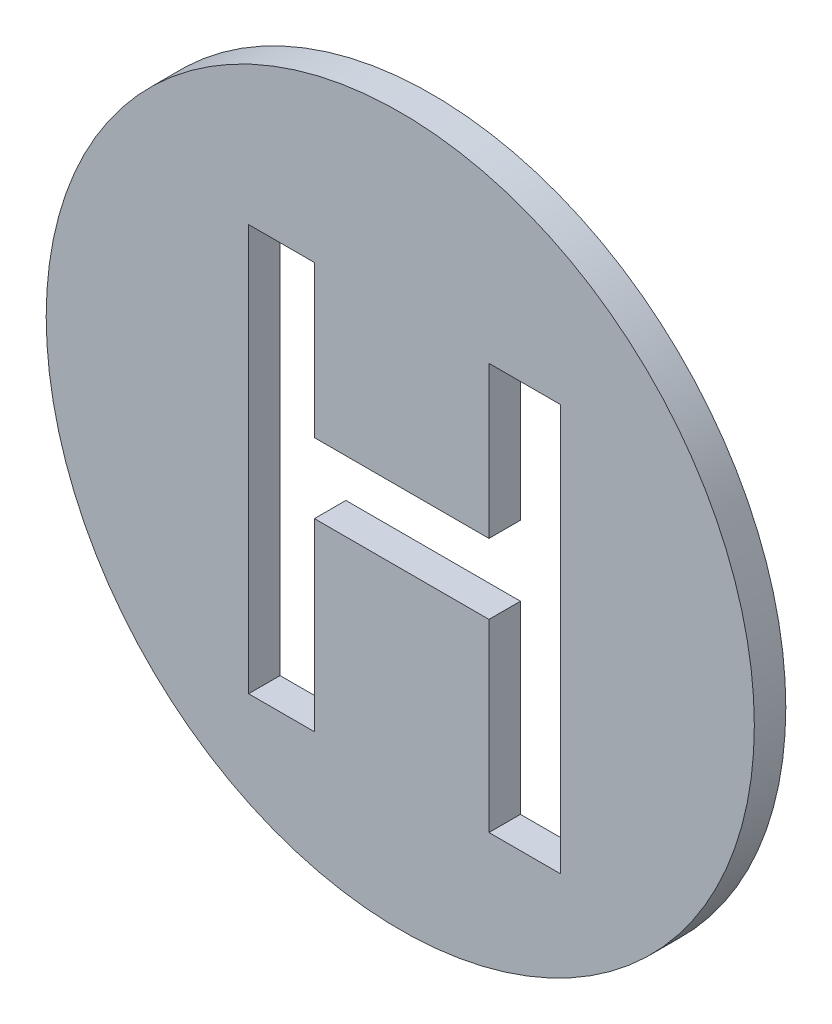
ISO-10303-21;
HEADER;
FILE_DESCRIPTION(('STEP AP214'),'2;1');
FILE_NAME('part.step','',(''),(''),'','','');
FILE_SCHEMA(('AUTOMOTIVE_DESIGN { 1 0 10303 214 1 1 1 1 }'));
ENDSEC;
DATA;
#1=APPLICATION_CONTEXT('core data for automotive mechanical design processes');
#2=APPLICATION_PROTOCOL_DEFINITION('international standard','automotive_design',2000,#1);
#3=PRODUCT_CONTEXT('',#1,'mechanical');
#4=PRODUCT('Part','Part','',(#3));
#5=PRODUCT_RELATED_PRODUCT_CATEGORY('part','',(#4));
#6=PRODUCT_DEFINITION_FORMATION('','',#4);
#7=PRODUCT_DEFINITION_CONTEXT('part definition',#1,'design');
#8=PRODUCT_DEFINITION('design','',#6,#7);
#9=PRODUCT_DEFINITION_SHAPE('','',#8);
#10=(LENGTH_UNIT() NAMED_UNIT(*) SI_UNIT(.MILLI.,.METRE.));
#11=(NAMED_UNIT(*) PLANE_ANGLE_UNIT() SI_UNIT($,.RADIAN.));
#12=(NAMED_UNIT(*) SI_UNIT($,.STERADIAN.) SOLID_ANGLE_UNIT());
#13=UNCERTAINTY_MEASURE_WITH_UNIT(LENGTH_MEASURE(1.E-05),#10,'distance_accuracy_value','');
#14=(GEOMETRIC_REPRESENTATION_CONTEXT(3) GLOBAL_UNCERTAINTY_ASSIGNED_CONTEXT((#13)) GLOBAL_UNIT_ASSIGNED_CONTEXT((#10,
#11,#12)) REPRESENTATION_CONTEXT('',''));
#15=CARTESIAN_POINT('',(0.,0.,0.));
#16=DIRECTION('',(0.,0.,1.));
#17=DIRECTION('',(1.,0.,0.));
#18=AXIS2_PLACEMENT_3D('',#15,#16,#17);
#19=CARTESIAN_POINT('',(0.,0.,4.));
#20=DIRECTION('',(0.,0.,-1.));
#21=DIRECTION('',(-1.,0.,0.));
#22=AXIS2_PLACEMENT_3D('',#19,#20,#21);
#23=CYLINDRICAL_SURFACE('',#22,45.);
#24=CARTESIAN_POINT('',(0.,0.,4.));
#25=DIRECTION('',(0.,0.,1.));
#26=DIRECTION('',(1.,0.,0.));
#27=AXIS2_PLACEMENT_3D('',#24,#25,#26);
#28=CIRCLE('',#27,45.);
#29=CARTESIAN_POINT('',(45.,0.,4.));
#30=VERTEX_POINT('',#29);
#31=EDGE_CURVE('E11',#30,#30,#28,.T.);
#32=ORIENTED_EDGE('',*,*,#31,.F.);
#33=EDGE_LOOP('',(#32));
#34=FACE_BOUND('',#33,.T.);
#35=CARTESIAN_POINT('',(0.,0.,0.));
#36=DIRECTION('',(0.,0.,1.));
#37=DIRECTION('',(1.,0.,0.));
#38=AXIS2_PLACEMENT_3D('',#35,#36,#37);
#39=CIRCLE('',#38,45.);
#40=CARTESIAN_POINT('',(45.,0.,0.));
#41=VERTEX_POINT('',#40);
#42=EDGE_CURVE('E36',#41,#41,#39,.T.);
#43=ORIENTED_EDGE('',*,*,#42,.T.);
#44=EDGE_LOOP('',(#43));
#45=FACE_BOUND('',#44,.T.);
#46=ADVANCED_FACE('F33',(#34,#45),#23,.T.);
#47=CARTESIAN_POINT('',(0.,0.,4.));
#48=DIRECTION('',(0.,0.,1.));
#49=DIRECTION('',(1.,0.,0.));
#50=AXIS2_PLACEMENT_3D('',#47,#48,#49);
#51=PLANE('',#50);
#52=DIRECTION('',(-1.,0.,0.));
#53=VECTOR('',#52,1.);
#54=CARTESIAN_POINT('',(-10.9106476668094,23.0032821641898,4.));
#55=LINE('',#54,#53);
#56=CARTESIAN_POINT('',(-10.9106476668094,23.0032821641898,4.));
#57=VERTEX_POINT('',#56);
#58=CARTESIAN_POINT('',(-19.2754775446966,23.0032821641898,4.));
#59=VERTEX_POINT('',#58);
#60=EDGE_CURVE('E47',#57,#59,#55,.T.);
#61=ORIENTED_EDGE('',*,*,#60,.F.);
#62=DIRECTION('',(0.,1.,0.));
#63=VECTOR('',#62,1.);
#64=CARTESIAN_POINT('',(-10.9106476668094,3.72780461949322,4.));
#65=LINE('',#64,#63);
#66=CARTESIAN_POINT('',(-10.9106476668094,3.72780461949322,4.));
#67=VERTEX_POINT('',#66);
#68=EDGE_CURVE('E140',#67,#57,#65,.T.);
#69=ORIENTED_EDGE('',*,*,#68,.F.);
#70=DIRECTION('',(-1.,0.,0.));
#71=VECTOR('',#70,1.);
#72=CARTESIAN_POINT('',(11.2743359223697,3.72780461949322,4.));
#73=LINE('',#72,#71);
#74=CARTESIAN_POINT('',(11.2743359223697,3.72780461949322,4.));
#75=VERTEX_POINT('',#74);
#76=EDGE_CURVE('E143',#75,#67,#73,.T.);
#77=ORIENTED_EDGE('',*,*,#76,.F.);
#78=DIRECTION('',(0.,-1.,0.));
#79=VECTOR('',#78,1.);
#80=CARTESIAN_POINT('',(11.2743359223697,23.0032821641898,4.));
#81=LINE('',#80,#79);
#82=CARTESIAN_POINT('',(11.2743359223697,23.0032821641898,4.));
#83=VERTEX_POINT('',#82);
#84=EDGE_CURVE('E195',#83,#75,#81,.T.);
#85=ORIENTED_EDGE('',*,*,#84,.F.);
#86=DIRECTION('',(-1.,0.,0.));
#87=VECTOR('',#86,1.);
#88=CARTESIAN_POINT('',(20.3665423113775,23.0032821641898,4.));
#89=LINE('',#88,#87);
#90=CARTESIAN_POINT('',(20.3665423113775,23.0032821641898,4.));
#91=VERTEX_POINT('',#90);
#92=EDGE_CURVE('E192',#91,#83,#89,.T.);
#93=ORIENTED_EDGE('',*,*,#92,.F.);
#94=DIRECTION('',(0.,1.,0.));
#95=VECTOR('',#94,1.);
#96=CARTESIAN_POINT('',(20.3665423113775,-28.6404501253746,4.));
#97=LINE('',#96,#95);
#98=CARTESIAN_POINT('',(20.3665423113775,-28.6404501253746,4.));
#99=VERTEX_POINT('',#98);
#100=EDGE_CURVE('E189',#99,#91,#97,.T.);
#101=ORIENTED_EDGE('',*,*,#100,.F.);
#102=DIRECTION('',(1.,0.,0.));
#103=VECTOR('',#102,1.);
#104=CARTESIAN_POINT('',(11.2743359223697,-28.6404501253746,4.));
#105=LINE('',#104,#103);
#106=CARTESIAN_POINT('',(11.2743359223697,-28.6404501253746,4.));
#107=VERTEX_POINT('',#106);
#108=EDGE_CURVE('E186',#107,#99,#105,.T.);
#109=ORIENTED_EDGE('',*,*,#108,.F.);
#110=DIRECTION('',(0.,-1.,0.));
#111=VECTOR('',#110,1.);
#112=CARTESIAN_POINT('',(11.2743359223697,-5.18255764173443,4.));
#113=LINE('',#112,#111);
#114=CARTESIAN_POINT('',(11.2743359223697,-5.18255764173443,4.));
#115=VERTEX_POINT('',#114);
#116=EDGE_CURVE('E183',#115,#107,#113,.T.);
#117=ORIENTED_EDGE('',*,*,#116,.F.);
#118=DIRECTION('',(1.,0.,0.));
#119=VECTOR('',#118,1.);
#120=CARTESIAN_POINT('',(-10.9106476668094,-5.18255764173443,4.));
#121=LINE('',#120,#119);
#122=CARTESIAN_POINT('',(-10.9106476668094,-5.18255764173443,4.));
#123=VERTEX_POINT('',#122);
#124=EDGE_CURVE('E180',#123,#115,#121,.T.);
#125=ORIENTED_EDGE('',*,*,#124,.F.);
#126=DIRECTION('',(0.,1.,0.));
#127=VECTOR('',#126,1.);
#128=CARTESIAN_POINT('',(-10.9106476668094,-28.6404501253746,4.));
#129=LINE('',#128,#127);
#130=CARTESIAN_POINT('',(-10.9106476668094,-28.6404501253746,4.));
#131=VERTEX_POINT('',#130);
#132=EDGE_CURVE('E177',#131,#123,#129,.T.);
#133=ORIENTED_EDGE('',*,*,#132,.F.);
#134=DIRECTION('',(1.,0.,0.));
#135=VECTOR('',#134,1.);
#136=CARTESIAN_POINT('',(-19.2754775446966,-28.6404501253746,4.));
#137=LINE('',#136,#135);
#138=CARTESIAN_POINT('',(-19.2754775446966,-28.6404501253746,4.));
#139=VERTEX_POINT('',#138);
#140=EDGE_CURVE('E174',#139,#131,#137,.T.);
#141=ORIENTED_EDGE('',*,*,#140,.F.);
#142=DIRECTION('',(0.,-1.,0.));
#143=VECTOR('',#142,1.);
#144=CARTESIAN_POINT('',(-19.2754775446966,23.0032821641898,4.));
#145=LINE('',#144,#143);
#146=EDGE_CURVE('E172',#59,#139,#145,.T.);
#147=ORIENTED_EDGE('',*,*,#146,.F.);
#148=EDGE_LOOP('',(#61,#69,#77,#85,#93,#101,#109,#117,#125,#133,#141,#147));
#149=FACE_BOUND('',#148,.T.);
#150=ORIENTED_EDGE('',*,*,#31,.T.);
#151=EDGE_LOOP('',(#150));
#152=FACE_BOUND('',#151,.T.);
#153=ADVANCED_FACE('F224',(#149,#152),#51,.T.);
#154=CARTESIAN_POINT('',(0.,0.,0.));
#155=DIRECTION('',(0.,0.,1.));
#156=DIRECTION('',(1.,0.,0.));
#157=AXIS2_PLACEMENT_3D('',#154,#155,#156);
#158=PLANE('',#157);
#159=DIRECTION('',(0.,1.,0.));
#160=VECTOR('',#159,1.);
#161=CARTESIAN_POINT('',(-10.9106476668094,3.72780461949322,0.));
#162=LINE('',#161,#160);
#163=CARTESIAN_POINT('',(-10.9106476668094,3.72780461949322,0.));
#164=VERTEX_POINT('',#163);
#165=CARTESIAN_POINT('',(-10.9106476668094,23.0032821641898,0.));
#166=VERTEX_POINT('',#165);
#167=EDGE_CURVE('E129',#164,#166,#162,.T.);
#168=ORIENTED_EDGE('',*,*,#167,.T.);
#169=DIRECTION('',(-1.,0.,0.));
#170=VECTOR('',#169,1.);
#171=CARTESIAN_POINT('',(-10.9106476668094,23.0032821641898,0.));
#172=LINE('',#171,#170);
#173=CARTESIAN_POINT('',(-19.2754775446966,23.0032821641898,0.));
#174=VERTEX_POINT('',#173);
#175=EDGE_CURVE('E123',#166,#174,#172,.T.);
#176=ORIENTED_EDGE('',*,*,#175,.T.);
#177=DIRECTION('',(0.,-1.,0.));
#178=VECTOR('',#177,1.);
#179=CARTESIAN_POINT('',(-19.2754775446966,23.0032821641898,0.));
#180=LINE('',#179,#178);
#181=CARTESIAN_POINT('',(-19.2754775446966,-28.6404501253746,0.));
#182=VERTEX_POINT('',#181);
#183=EDGE_CURVE('E132',#174,#182,#180,.T.);
#184=ORIENTED_EDGE('',*,*,#183,.T.);
#185=DIRECTION('',(1.,0.,0.));
#186=VECTOR('',#185,1.);
#187=CARTESIAN_POINT('',(-19.2754775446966,-28.6404501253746,0.));
#188=LINE('',#187,#186);
#189=CARTESIAN_POINT('',(-10.9106476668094,-28.6404501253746,0.));
#190=VERTEX_POINT('',#189);
#191=EDGE_CURVE('E55',#182,#190,#188,.T.);
#192=ORIENTED_EDGE('',*,*,#191,.T.);
#193=DIRECTION('',(0.,1.,0.));
#194=VECTOR('',#193,1.);
#195=CARTESIAN_POINT('',(-10.9106476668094,-28.6404501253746,0.));
#196=LINE('',#195,#194);
#197=CARTESIAN_POINT('',(-10.9106476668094,-5.18255764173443,0.));
#198=VERTEX_POINT('',#197);
#199=EDGE_CURVE('E147',#190,#198,#196,.T.);
#200=ORIENTED_EDGE('',*,*,#199,.T.);
#201=DIRECTION('',(1.,0.,0.));
#202=VECTOR('',#201,1.);
#203=CARTESIAN_POINT('',(-10.9106476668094,-5.18255764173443,0.));
#204=LINE('',#203,#202);
#205=CARTESIAN_POINT('',(11.2743359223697,-5.18255764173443,0.));
#206=VERTEX_POINT('',#205);
#207=EDGE_CURVE('E150',#198,#206,#204,.T.);
#208=ORIENTED_EDGE('',*,*,#207,.T.);
#209=DIRECTION('',(0.,-1.,0.));
#210=VECTOR('',#209,1.);
#211=CARTESIAN_POINT('',(11.2743359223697,-5.18255764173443,0.));
#212=LINE('',#211,#210);
#213=CARTESIAN_POINT('',(11.2743359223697,-28.6404501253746,0.));
#214=VERTEX_POINT('',#213);
#215=EDGE_CURVE('E153',#206,#214,#212,.T.);
#216=ORIENTED_EDGE('',*,*,#215,.T.);
#217=DIRECTION('',(1.,0.,0.));
#218=VECTOR('',#217,1.);
#219=CARTESIAN_POINT('',(11.2743359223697,-28.6404501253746,0.));
#220=LINE('',#219,#218);
#221=CARTESIAN_POINT('',(20.3665423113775,-28.6404501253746,0.));
#222=VERTEX_POINT('',#221);
#223=EDGE_CURVE('E156',#214,#222,#220,.T.);
#224=ORIENTED_EDGE('',*,*,#223,.T.);
#225=DIRECTION('',(0.,1.,0.));
#226=VECTOR('',#225,1.);
#227=CARTESIAN_POINT('',(20.3665423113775,-28.6404501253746,0.));
#228=LINE('',#227,#226);
#229=CARTESIAN_POINT('',(20.3665423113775,23.0032821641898,0.));
#230=VERTEX_POINT('',#229);
#231=EDGE_CURVE('E159',#222,#230,#228,.T.);
#232=ORIENTED_EDGE('',*,*,#231,.T.);
#233=DIRECTION('',(-1.,0.,0.));
#234=VECTOR('',#233,1.);
#235=CARTESIAN_POINT('',(20.3665423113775,23.0032821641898,0.));
#236=LINE('',#235,#234);
#237=CARTESIAN_POINT('',(11.2743359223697,23.0032821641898,0.));
#238=VERTEX_POINT('',#237);
#239=EDGE_CURVE('E162',#230,#238,#236,.T.);
#240=ORIENTED_EDGE('',*,*,#239,.T.);
#241=DIRECTION('',(0.,-1.,0.));
#242=VECTOR('',#241,1.);
#243=CARTESIAN_POINT('',(11.2743359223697,23.0032821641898,0.));
#244=LINE('',#243,#242);
#245=CARTESIAN_POINT('',(11.2743359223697,3.72780461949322,0.));
#246=VERTEX_POINT('',#245);
#247=EDGE_CURVE('E165',#238,#246,#244,.T.);
#248=ORIENTED_EDGE('',*,*,#247,.T.);
#249=DIRECTION('',(-1.,0.,0.));
#250=VECTOR('',#249,1.);
#251=CARTESIAN_POINT('',(11.2743359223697,3.72780461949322,0.));
#252=LINE('',#251,#250);
#253=EDGE_CURVE('E168',#246,#164,#252,.T.);
#254=ORIENTED_EDGE('',*,*,#253,.T.);
#255=EDGE_LOOP('',(#168,#176,#184,#192,#200,#208,#216,#224,#232,#240,#248,#254));
#256=FACE_BOUND('',#255,.T.);
#257=ORIENTED_EDGE('',*,*,#42,.F.);
#258=EDGE_LOOP('',(#257));
#259=FACE_BOUND('',#258,.T.);
#260=ADVANCED_FACE('F136',(#256,#259),#158,.F.);
#261=CARTESIAN_POINT('',(-10.9106476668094,23.0032821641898,0.));
#262=DIRECTION('',(0.,1.,0.));
#263=DIRECTION('',(0.,0.,1.));
#264=AXIS2_PLACEMENT_3D('',#261,#262,#263);
#265=PLANE('',#264);
#266=ORIENTED_EDGE('',*,*,#60,.T.);
#267=DIRECTION('',(0.,0.,1.));
#268=VECTOR('',#267,1.);
#269=CARTESIAN_POINT('',(-19.2754775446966,23.0032821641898,0.));
#270=LINE('',#269,#268);
#271=EDGE_CURVE('E119',#174,#59,#270,.T.);
#272=ORIENTED_EDGE('',*,*,#271,.F.);
#273=ORIENTED_EDGE('',*,*,#175,.F.);
#274=DIRECTION('',(0.,0.,1.));
#275=VECTOR('',#274,1.);
#276=CARTESIAN_POINT('',(-10.9106476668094,23.0032821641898,0.));
#277=LINE('',#276,#275);
#278=EDGE_CURVE('E200',#166,#57,#277,.T.);
#279=ORIENTED_EDGE('',*,*,#278,.T.);
#280=EDGE_LOOP('',(#266,#272,#273,#279));
#281=FACE_BOUND('',#280,.T.);
#282=ADVANCED_FACE('F121',(#281),#265,.F.);
#283=CARTESIAN_POINT('',(-10.9106476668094,3.72780461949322,0.));
#284=DIRECTION('',(1.,0.,0.));
#285=DIRECTION('',(0.,0.,-1.));
#286=AXIS2_PLACEMENT_3D('',#283,#284,#285);
#287=PLANE('',#286);
#288=ORIENTED_EDGE('',*,*,#68,.T.);
#289=ORIENTED_EDGE('',*,*,#278,.F.);
#290=ORIENTED_EDGE('',*,*,#167,.F.);
#291=DIRECTION('',(0.,0.,1.));
#292=VECTOR('',#291,1.);
#293=CARTESIAN_POINT('',(-10.9106476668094,3.72780461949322,0.));
#294=LINE('',#293,#292);
#295=EDGE_CURVE('E202',#164,#67,#294,.T.);
#296=ORIENTED_EDGE('',*,*,#295,.T.);
#297=EDGE_LOOP('',(#288,#289,#290,#296));
#298=FACE_BOUND('',#297,.T.);
#299=ADVANCED_FACE('F259',(#298),#287,.F.);
#300=CARTESIAN_POINT('',(11.2743359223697,3.72780461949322,0.));
#301=DIRECTION('',(0.,1.,0.));
#302=DIRECTION('',(-1.,0.,0.));
#303=AXIS2_PLACEMENT_3D('',#300,#301,#302);
#304=PLANE('',#303);
#305=ORIENTED_EDGE('',*,*,#76,.T.);
#306=ORIENTED_EDGE('',*,*,#295,.F.);
#307=ORIENTED_EDGE('',*,*,#253,.F.);
#308=DIRECTION('',(0.,0.,1.));
#309=VECTOR('',#308,1.);
#310=CARTESIAN_POINT('',(11.2743359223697,3.72780461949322,0.));
#311=LINE('',#310,#309);
#312=EDGE_CURVE('E204',#246,#75,#311,.T.);
#313=ORIENTED_EDGE('',*,*,#312,.T.);
#314=EDGE_LOOP('',(#305,#306,#307,#313));
#315=FACE_BOUND('',#314,.T.);
#316=ADVANCED_FACE('F255',(#315),#304,.F.);
#317=CARTESIAN_POINT('',(11.2743359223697,23.0032821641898,0.));
#318=DIRECTION('',(-1.,0.,0.));
#319=DIRECTION('',(0.,0.,1.));
#320=AXIS2_PLACEMENT_3D('',#317,#318,#319);
#321=PLANE('',#320);
#322=ORIENTED_EDGE('',*,*,#84,.T.);
#323=ORIENTED_EDGE('',*,*,#312,.F.);
#324=ORIENTED_EDGE('',*,*,#247,.F.);
#325=DIRECTION('',(0.,0.,1.));
#326=VECTOR('',#325,1.);
#327=CARTESIAN_POINT('',(11.2743359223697,23.0032821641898,0.));
#328=LINE('',#327,#326);
#329=EDGE_CURVE('E206',#238,#83,#328,.T.);
#330=ORIENTED_EDGE('',*,*,#329,.T.);
#331=EDGE_LOOP('',(#322,#323,#324,#330));
#332=FACE_BOUND('',#331,.T.);
#333=ADVANCED_FACE('F252',(#332),#321,.F.);
#334=CARTESIAN_POINT('',(20.3665423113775,23.0032821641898,0.));
#335=DIRECTION('',(0.,1.,0.));
#336=DIRECTION('',(0.,0.,1.));
#337=AXIS2_PLACEMENT_3D('',#334,#335,#336);
#338=PLANE('',#337);
#339=ORIENTED_EDGE('',*,*,#92,.T.);
#340=ORIENTED_EDGE('',*,*,#329,.F.);
#341=ORIENTED_EDGE('',*,*,#239,.F.);
#342=DIRECTION('',(0.,0.,1.));
#343=VECTOR('',#342,1.);
#344=CARTESIAN_POINT('',(20.3665423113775,23.0032821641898,0.));
#345=LINE('',#344,#343);
#346=EDGE_CURVE('E208',#230,#91,#345,.T.);
#347=ORIENTED_EDGE('',*,*,#346,.T.);
#348=EDGE_LOOP('',(#339,#340,#341,#347));
#349=FACE_BOUND('',#348,.T.);
#350=ADVANCED_FACE('F248',(#349),#338,.F.);
#351=CARTESIAN_POINT('',(20.3665423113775,-28.6404501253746,0.));
#352=DIRECTION('',(1.,0.,0.));
#353=DIRECTION('',(0.,0.,-1.));
#354=AXIS2_PLACEMENT_3D('',#351,#352,#353);
#355=PLANE('',#354);
#356=ORIENTED_EDGE('',*,*,#100,.T.);
#357=ORIENTED_EDGE('',*,*,#346,.F.);
#358=ORIENTED_EDGE('',*,*,#231,.F.);
#359=DIRECTION('',(0.,0.,1.));
#360=VECTOR('',#359,1.);
#361=CARTESIAN_POINT('',(20.3665423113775,-28.6404501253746,0.));
#362=LINE('',#361,#360);
#363=EDGE_CURVE('E210',#222,#99,#362,.T.);
#364=ORIENTED_EDGE('',*,*,#363,.T.);
#365=EDGE_LOOP('',(#356,#357,#358,#364));
#366=FACE_BOUND('',#365,.T.);
#367=ADVANCED_FACE('F244',(#366),#355,.F.);
#368=CARTESIAN_POINT('',(11.2743359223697,-28.6404501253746,0.));
#369=DIRECTION('',(0.,-1.,0.));
#370=DIRECTION('',(0.,0.,-1.));
#371=AXIS2_PLACEMENT_3D('',#368,#369,#370);
#372=PLANE('',#371);
#373=ORIENTED_EDGE('',*,*,#108,.T.);
#374=ORIENTED_EDGE('',*,*,#363,.F.);
#375=ORIENTED_EDGE('',*,*,#223,.F.);
#376=DIRECTION('',(0.,0.,1.));
#377=VECTOR('',#376,1.);
#378=CARTESIAN_POINT('',(11.2743359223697,-28.6404501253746,0.));
#379=LINE('',#378,#377);
#380=EDGE_CURVE('E212',#214,#107,#379,.T.);
#381=ORIENTED_EDGE('',*,*,#380,.T.);
#382=EDGE_LOOP('',(#373,#374,#375,#381));
#383=FACE_BOUND('',#382,.T.);
#384=ADVANCED_FACE('F240',(#383),#372,.F.);
#385=CARTESIAN_POINT('',(11.2743359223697,-5.18255764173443,0.));
#386=DIRECTION('',(-1.,0.,0.));
#387=DIRECTION('',(0.,0.,1.));
#388=AXIS2_PLACEMENT_3D('',#385,#386,#387);
#389=PLANE('',#388);
#390=ORIENTED_EDGE('',*,*,#116,.T.);
#391=ORIENTED_EDGE('',*,*,#380,.F.);
#392=ORIENTED_EDGE('',*,*,#215,.F.);
#393=DIRECTION('',(0.,0.,1.));
#394=VECTOR('',#393,1.);
#395=CARTESIAN_POINT('',(11.2743359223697,-5.18255764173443,0.));
#396=LINE('',#395,#394);
#397=EDGE_CURVE('E214',#206,#115,#396,.T.);
#398=ORIENTED_EDGE('',*,*,#397,.T.);
#399=EDGE_LOOP('',(#390,#391,#392,#398));
#400=FACE_BOUND('',#399,.T.);
#401=ADVANCED_FACE('F236',(#400),#389,.F.);
#402=CARTESIAN_POINT('',(-10.9106476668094,-5.18255764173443,0.));
#403=DIRECTION('',(0.,-1.,0.));
#404=DIRECTION('',(0.,0.,-1.));
#405=AXIS2_PLACEMENT_3D('',#402,#403,#404);
#406=PLANE('',#405);
#407=ORIENTED_EDGE('',*,*,#124,.T.);
#408=ORIENTED_EDGE('',*,*,#397,.F.);
#409=ORIENTED_EDGE('',*,*,#207,.F.);
#410=DIRECTION('',(0.,0.,1.));
#411=VECTOR('',#410,1.);
#412=CARTESIAN_POINT('',(-10.9106476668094,-5.18255764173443,0.));
#413=LINE('',#412,#411);
#414=EDGE_CURVE('E216',#198,#123,#413,.T.);
#415=ORIENTED_EDGE('',*,*,#414,.T.);
#416=EDGE_LOOP('',(#407,#408,#409,#415));
#417=FACE_BOUND('',#416,.T.);
#418=ADVANCED_FACE('F234',(#417),#406,.F.);
#419=CARTESIAN_POINT('',(-10.9106476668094,-28.6404501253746,0.));
#420=DIRECTION('',(1.,0.,0.));
#421=DIRECTION('',(0.,0.,-1.));
#422=AXIS2_PLACEMENT_3D('',#419,#420,#421);
#423=PLANE('',#422);
#424=ORIENTED_EDGE('',*,*,#132,.T.);
#425=ORIENTED_EDGE('',*,*,#414,.F.);
#426=ORIENTED_EDGE('',*,*,#199,.F.);
#427=DIRECTION('',(0.,0.,1.));
#428=VECTOR('',#427,1.);
#429=CARTESIAN_POINT('',(-10.9106476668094,-28.6404501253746,0.));
#430=LINE('',#429,#428);
#431=EDGE_CURVE('E218',#190,#131,#430,.T.);
#432=ORIENTED_EDGE('',*,*,#431,.T.);
#433=EDGE_LOOP('',(#424,#425,#426,#432));
#434=FACE_BOUND('',#433,.T.);
#435=ADVANCED_FACE('F229',(#434),#423,.F.);
#436=CARTESIAN_POINT('',(-19.2754775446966,-28.6404501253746,0.));
#437=DIRECTION('',(0.,-1.,0.));
#438=DIRECTION('',(0.,0.,-1.));
#439=AXIS2_PLACEMENT_3D('',#436,#437,#438);
#440=PLANE('',#439);
#441=ORIENTED_EDGE('',*,*,#140,.T.);
#442=ORIENTED_EDGE('',*,*,#431,.F.);
#443=ORIENTED_EDGE('',*,*,#191,.F.);
#444=DIRECTION('',(0.,0.,1.));
#445=VECTOR('',#444,1.);
#446=CARTESIAN_POINT('',(-19.2754775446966,-28.6404501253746,0.));
#447=LINE('',#446,#445);
#448=EDGE_CURVE('E128',#182,#139,#447,.T.);
#449=ORIENTED_EDGE('',*,*,#448,.T.);
#450=EDGE_LOOP('',(#441,#442,#443,#449));
#451=FACE_BOUND('',#450,.T.);
#452=ADVANCED_FACE('F220',(#451),#440,.F.);
#453=CARTESIAN_POINT('',(-19.2754775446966,23.0032821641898,0.));
#454=DIRECTION('',(-1.,0.,0.));
#455=DIRECTION('',(0.,0.,1.));
#456=AXIS2_PLACEMENT_3D('',#453,#454,#455);
#457=PLANE('',#456);
#458=ORIENTED_EDGE('',*,*,#146,.T.);
#459=ORIENTED_EDGE('',*,*,#448,.F.);
#460=ORIENTED_EDGE('',*,*,#183,.F.);
#461=ORIENTED_EDGE('',*,*,#271,.T.);
#462=EDGE_LOOP('',(#458,#459,#460,#461));
#463=FACE_BOUND('',#462,.T.);
#464=ADVANCED_FACE('F133',(#463),#457,.F.);
#465=CLOSED_SHELL('',(#46,#153,#260,#282,#299,#316,#333,#350,#367,#384,#401,#418,#435,#452,#464));
#466=MANIFOLD_SOLID_BREP('B2',#465);
#467=ADVANCED_BREP_SHAPE_REPRESENTATION('',(#18,#466),#14);
#468=SHAPE_DEFINITION_REPRESENTATION(#9,#467);
ENDSEC;
END-ISO-10303-21;
